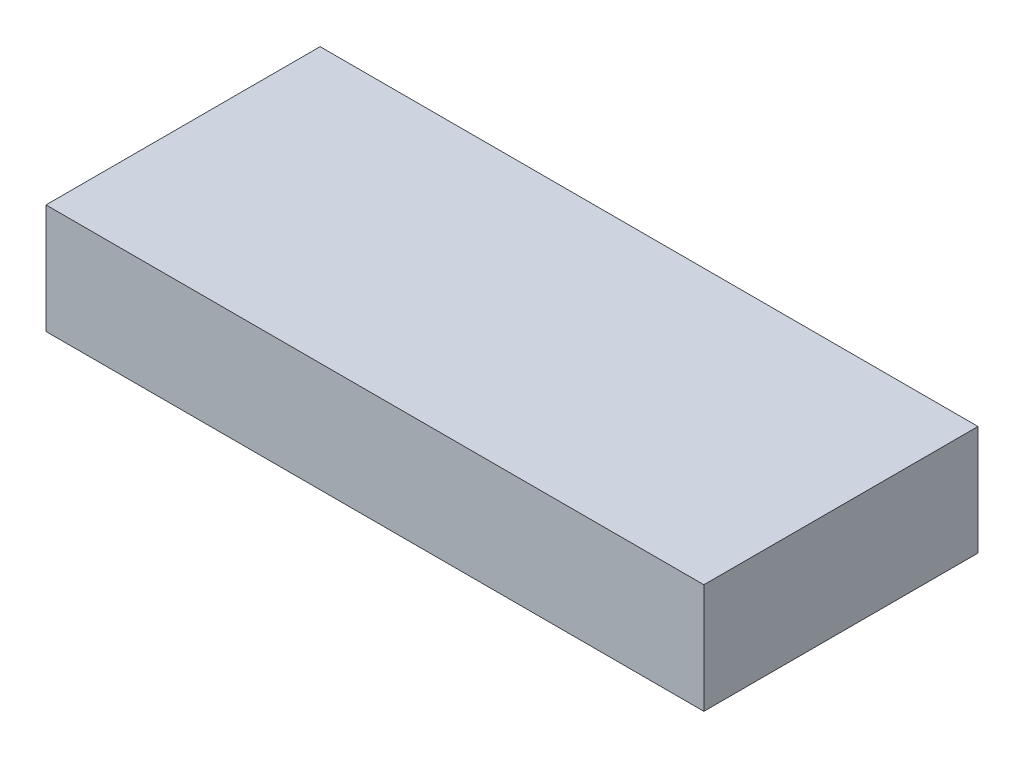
ISO-10303-21;
HEADER;
FILE_DESCRIPTION(('STEP AP214'),'2;1');
FILE_NAME('part.step','',(''),(''),'','','');
FILE_SCHEMA(('AUTOMOTIVE_DESIGN { 1 0 10303 214 1 1 1 1 }'));
ENDSEC;
DATA;
#1=APPLICATION_CONTEXT('core data for automotive mechanical design processes');
#2=APPLICATION_PROTOCOL_DEFINITION('international standard','automotive_design',2000,#1);
#3=PRODUCT_CONTEXT('',#1,'mechanical');
#4=PRODUCT('Part','Part','',(#3));
#5=PRODUCT_RELATED_PRODUCT_CATEGORY('part','',(#4));
#6=PRODUCT_DEFINITION_FORMATION('','',#4);
#7=PRODUCT_DEFINITION_CONTEXT('part definition',#1,'design');
#8=PRODUCT_DEFINITION('design','',#6,#7);
#9=PRODUCT_DEFINITION_SHAPE('','',#8);
#10=(LENGTH_UNIT() NAMED_UNIT(*) SI_UNIT(.MILLI.,.METRE.));
#11=(NAMED_UNIT(*) PLANE_ANGLE_UNIT() SI_UNIT($,.RADIAN.));
#12=(NAMED_UNIT(*) SI_UNIT($,.STERADIAN.) SOLID_ANGLE_UNIT());
#13=UNCERTAINTY_MEASURE_WITH_UNIT(LENGTH_MEASURE(1.E-05),#10,'distance_accuracy_value','');
#14=(GEOMETRIC_REPRESENTATION_CONTEXT(3) GLOBAL_UNCERTAINTY_ASSIGNED_CONTEXT((#13)) GLOBAL_UNIT_ASSIGNED_CONTEXT((#10,
#11,#12)) REPRESENTATION_CONTEXT('',''));
#15=CARTESIAN_POINT('',(0.,0.,0.));
#16=DIRECTION('',(0.,0.,1.));
#17=DIRECTION('',(1.,0.,0.));
#18=AXIS2_PLACEMENT_3D('',#15,#16,#17);
#19=CARTESIAN_POINT('',(30.,10.,-12.5));
#20=DIRECTION('',(-1.,0.,0.));
#21=DIRECTION('',(0.,0.,1.));
#22=AXIS2_PLACEMENT_3D('',#19,#20,#21);
#23=PLANE('',#22);
#24=DIRECTION('',(0.,0.,-1.));
#25=VECTOR('',#24,1.);
#26=CARTESIAN_POINT('',(30.,0.,-12.5));
#27=LINE('',#26,#25);
#28=CARTESIAN_POINT('',(30.,0.,12.5));
#29=VERTEX_POINT('',#28);
#30=CARTESIAN_POINT('',(30.,0.,-12.5));
#31=VERTEX_POINT('',#30);
#32=EDGE_CURVE('E111',#29,#31,#27,.T.);
#33=ORIENTED_EDGE('',*,*,#32,.T.);
#34=DIRECTION('',(0.,-1.,0.));
#35=VECTOR('',#34,1.);
#36=CARTESIAN_POINT('',(30.,10.,-12.5));
#37=LINE('',#36,#35);
#38=CARTESIAN_POINT('',(30.,10.,-12.5));
#39=VERTEX_POINT('',#38);
#40=EDGE_CURVE('E11',#39,#31,#37,.T.);
#41=ORIENTED_EDGE('',*,*,#40,.F.);
#42=DIRECTION('',(0.,0.,-1.));
#43=VECTOR('',#42,1.);
#44=CARTESIAN_POINT('',(30.,10.,-12.5));
#45=LINE('',#44,#43);
#46=CARTESIAN_POINT('',(30.,10.,12.5));
#47=VERTEX_POINT('',#46);
#48=EDGE_CURVE('E95',#47,#39,#45,.T.);
#49=ORIENTED_EDGE('',*,*,#48,.F.);
#50=DIRECTION('',(0.,-1.,0.));
#51=VECTOR('',#50,1.);
#52=CARTESIAN_POINT('',(30.,10.,12.5));
#53=LINE('',#52,#51);
#54=EDGE_CURVE('E107',#47,#29,#53,.T.);
#55=ORIENTED_EDGE('',*,*,#54,.T.);
#56=EDGE_LOOP('',(#33,#41,#49,#55));
#57=FACE_BOUND('',#56,.T.);
#58=ADVANCED_FACE('F43',(#57),#23,.F.);
#59=CARTESIAN_POINT('',(-30.,10.,-12.5));
#60=DIRECTION('',(0.,0.,1.));
#61=DIRECTION('',(1.,0.,0.));
#62=AXIS2_PLACEMENT_3D('',#59,#60,#61);
#63=PLANE('',#62);
#64=DIRECTION('',(-1.,0.,0.));
#65=VECTOR('',#64,1.);
#66=CARTESIAN_POINT('',(-30.,0.,-12.5));
#67=LINE('',#66,#65);
#68=CARTESIAN_POINT('',(-30.,0.,-12.5));
#69=VERTEX_POINT('',#68);
#70=EDGE_CURVE('E100',#31,#69,#67,.T.);
#71=ORIENTED_EDGE('',*,*,#70,.T.);
#72=DIRECTION('',(0.,-1.,0.));
#73=VECTOR('',#72,1.);
#74=CARTESIAN_POINT('',(-30.,10.,-12.5));
#75=LINE('',#74,#73);
#76=CARTESIAN_POINT('',(-30.,10.,-12.5));
#77=VERTEX_POINT('',#76);
#78=EDGE_CURVE('E52',#77,#69,#75,.T.);
#79=ORIENTED_EDGE('',*,*,#78,.F.);
#80=DIRECTION('',(-1.,0.,0.));
#81=VECTOR('',#80,1.);
#82=CARTESIAN_POINT('',(-30.,10.,-12.5));
#83=LINE('',#82,#81);
#84=EDGE_CURVE('E90',#39,#77,#83,.T.);
#85=ORIENTED_EDGE('',*,*,#84,.F.);
#86=ORIENTED_EDGE('',*,*,#40,.T.);
#87=EDGE_LOOP('',(#71,#79,#85,#86));
#88=FACE_BOUND('',#87,.T.);
#89=ADVANCED_FACE('F99',(#88),#63,.F.);
#90=CARTESIAN_POINT('',(-30.,10.,-12.5));
#91=DIRECTION('',(1.,0.,0.));
#92=DIRECTION('',(0.,0.,-1.));
#93=AXIS2_PLACEMENT_3D('',#90,#91,#92);
#94=PLANE('',#93);
#95=DIRECTION('',(0.,0.,1.));
#96=VECTOR('',#95,1.);
#97=CARTESIAN_POINT('',(-30.,0.,-12.5));
#98=LINE('',#97,#96);
#99=CARTESIAN_POINT('',(-30.,0.,12.5));
#100=VERTEX_POINT('',#99);
#101=EDGE_CURVE('E77',#69,#100,#98,.T.);
#102=ORIENTED_EDGE('',*,*,#101,.T.);
#103=DIRECTION('',(0.,-1.,0.));
#104=VECTOR('',#103,1.);
#105=CARTESIAN_POINT('',(-30.,10.,12.5));
#106=LINE('',#105,#104);
#107=CARTESIAN_POINT('',(-30.,10.,12.5));
#108=VERTEX_POINT('',#107);
#109=EDGE_CURVE('E102',#108,#100,#106,.T.);
#110=ORIENTED_EDGE('',*,*,#109,.F.);
#111=DIRECTION('',(0.,0.,1.));
#112=VECTOR('',#111,1.);
#113=CARTESIAN_POINT('',(-30.,10.,-12.5));
#114=LINE('',#113,#112);
#115=EDGE_CURVE('E93',#77,#108,#114,.T.);
#116=ORIENTED_EDGE('',*,*,#115,.F.);
#117=ORIENTED_EDGE('',*,*,#78,.T.);
#118=EDGE_LOOP('',(#102,#110,#116,#117));
#119=FACE_BOUND('',#118,.T.);
#120=ADVANCED_FACE('F103',(#119),#94,.F.);
#121=CARTESIAN_POINT('',(-30.,10.,12.5));
#122=DIRECTION('',(0.,0.,-1.));
#123=DIRECTION('',(-1.,0.,0.));
#124=AXIS2_PLACEMENT_3D('',#121,#122,#123);
#125=PLANE('',#124);
#126=DIRECTION('',(1.,0.,0.));
#127=VECTOR('',#126,1.);
#128=CARTESIAN_POINT('',(-30.,0.,12.5));
#129=LINE('',#128,#127);
#130=EDGE_CURVE('E83',#100,#29,#129,.T.);
#131=ORIENTED_EDGE('',*,*,#130,.T.);
#132=ORIENTED_EDGE('',*,*,#54,.F.);
#133=DIRECTION('',(1.,0.,0.));
#134=VECTOR('',#133,1.);
#135=CARTESIAN_POINT('',(-30.,10.,12.5));
#136=LINE('',#135,#134);
#137=EDGE_CURVE('E60',#108,#47,#136,.T.);
#138=ORIENTED_EDGE('',*,*,#137,.F.);
#139=ORIENTED_EDGE('',*,*,#109,.T.);
#140=EDGE_LOOP('',(#131,#132,#138,#139));
#141=FACE_BOUND('',#140,.T.);
#142=ADVANCED_FACE('F124',(#141),#125,.F.);
#143=CARTESIAN_POINT('',(0.,10.,0.));
#144=DIRECTION('',(0.,1.,0.));
#145=DIRECTION('',(0.,0.,1.));
#146=AXIS2_PLACEMENT_3D('',#143,#144,#145);
#147=PLANE('',#146);
#148=ORIENTED_EDGE('',*,*,#48,.T.);
#149=ORIENTED_EDGE('',*,*,#84,.T.);
#150=ORIENTED_EDGE('',*,*,#115,.T.);
#151=ORIENTED_EDGE('',*,*,#137,.T.);
#152=EDGE_LOOP('',(#148,#149,#150,#151));
#153=FACE_BOUND('',#152,.T.);
#154=ADVANCED_FACE('F91',(#153),#147,.T.);
#155=CARTESIAN_POINT('',(0.,0.,0.));
#156=DIRECTION('',(0.,1.,0.));
#157=DIRECTION('',(0.,0.,1.));
#158=AXIS2_PLACEMENT_3D('',#155,#156,#157);
#159=PLANE('',#158);
#160=ORIENTED_EDGE('',*,*,#32,.F.);
#161=ORIENTED_EDGE('',*,*,#130,.F.);
#162=ORIENTED_EDGE('',*,*,#101,.F.);
#163=ORIENTED_EDGE('',*,*,#70,.F.);
#164=EDGE_LOOP('',(#160,#161,#162,#163));
#165=FACE_BOUND('',#164,.T.);
#166=ADVANCED_FACE('F127',(#165),#159,.F.);
#167=CLOSED_SHELL('',(#58,#89,#120,#142,#154,#166));
#168=MANIFOLD_SOLID_BREP('B2',#167);
#169=ADVANCED_BREP_SHAPE_REPRESENTATION('',(#18,#168),#14);
#170=SHAPE_DEFINITION_REPRESENTATION(#9,#169);
ENDSEC;
END-ISO-10303-21;
